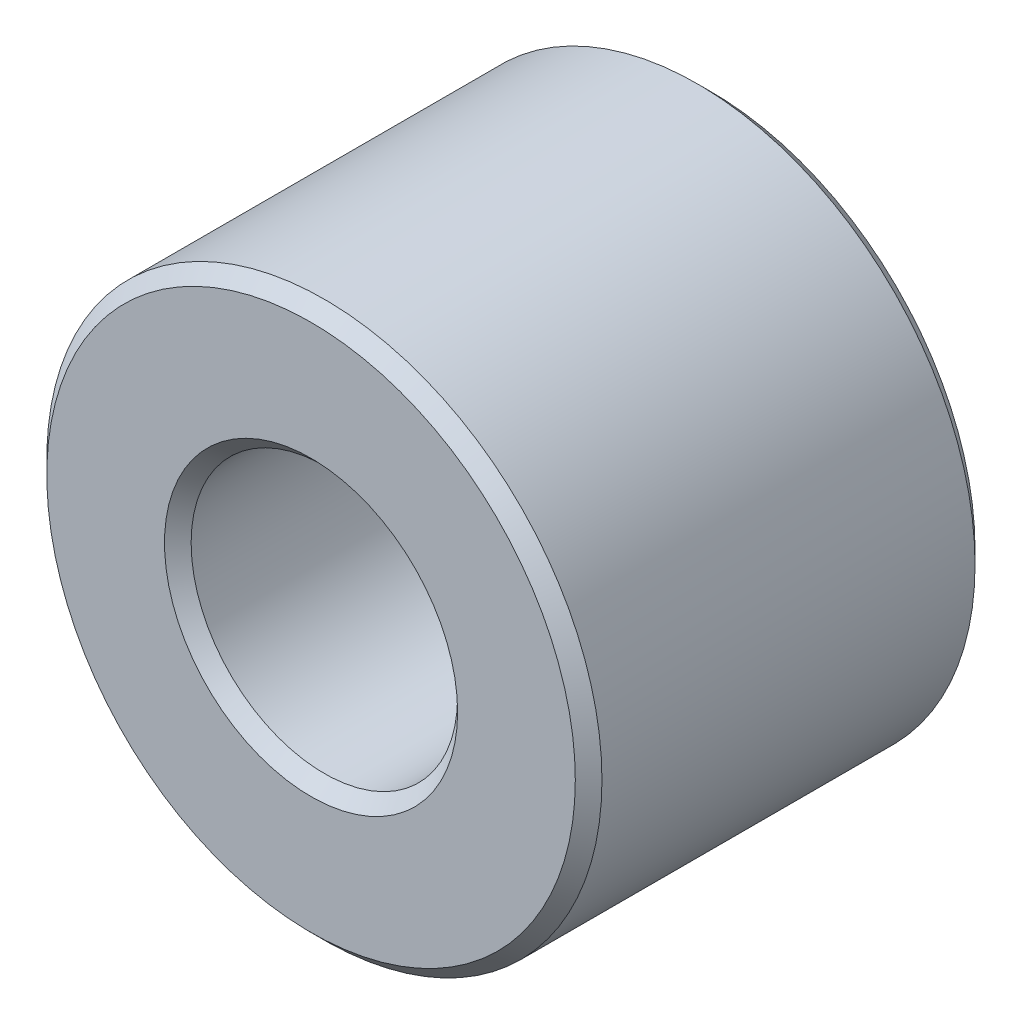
from build123d import *

# Parameters (mm, degrees)
SKETCH1_R           = 37.5
SKETCH1_R_2         = 18
BOSS_EXTRUDE1_DEPTH = 27
CHAMFER1_SIZE       = 1.8


with BuildPart() as part:
    # Sketch1 → Boss-Extrude1 (new, symmetric)
    with BuildSketch(Plane.XY):
        Circle(SKETCH1_R)
        Circle(SKETCH1_R_2, mode=Mode.SUBTRACT)
    extrude(amount=BOSS_EXTRUDE1_DEPTH, both=True)

    # Chamfer1
    chamfer1_edges = [part.edges().sort_by_distance(p)[0] for p in [
        (-37.5, 0, -27),
        (-37.5, 0, 27),
        (-18, 0, -27),
        (-18, 0, 27),
    ]]
    chamfer(chamfer1_edges, length=CHAMFER1_SIZE)


solid = part.part
